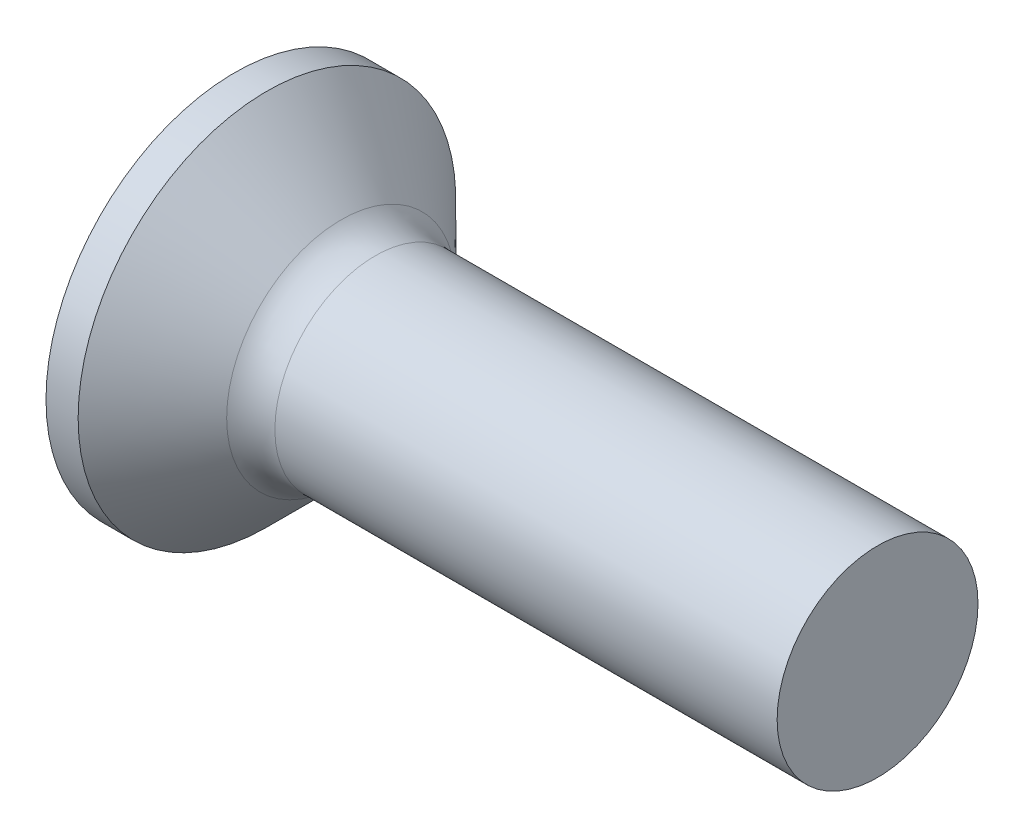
ISO-10303-21;
HEADER;
FILE_DESCRIPTION(('STEP AP214'),'2;1');
FILE_NAME('part.step','',(''),(''),'','','');
FILE_SCHEMA(('AUTOMOTIVE_DESIGN { 1 0 10303 214 1 1 1 1 }'));
ENDSEC;
DATA;
#1=APPLICATION_CONTEXT('core data for automotive mechanical design processes');
#2=APPLICATION_PROTOCOL_DEFINITION('international standard','automotive_design',2000,#1);
#3=PRODUCT_CONTEXT('',#1,'mechanical');
#4=PRODUCT('Part','Part','',(#3));
#5=PRODUCT_RELATED_PRODUCT_CATEGORY('part','',(#4));
#6=PRODUCT_DEFINITION_FORMATION('','',#4);
#7=PRODUCT_DEFINITION_CONTEXT('part definition',#1,'design');
#8=PRODUCT_DEFINITION('design','',#6,#7);
#9=PRODUCT_DEFINITION_SHAPE('','',#8);
#10=(LENGTH_UNIT() NAMED_UNIT(*) SI_UNIT(.MILLI.,.METRE.));
#11=(NAMED_UNIT(*) PLANE_ANGLE_UNIT() SI_UNIT($,.RADIAN.));
#12=(NAMED_UNIT(*) SI_UNIT($,.STERADIAN.) SOLID_ANGLE_UNIT());
#13=UNCERTAINTY_MEASURE_WITH_UNIT(LENGTH_MEASURE(1.E-05),#10,'distance_accuracy_value','');
#14=(GEOMETRIC_REPRESENTATION_CONTEXT(3) GLOBAL_UNCERTAINTY_ASSIGNED_CONTEXT((#13)) GLOBAL_UNIT_ASSIGNED_CONTEXT((#10,
#11,#12)) REPRESENTATION_CONTEXT('',''));
#15=CARTESIAN_POINT('',(0.,0.,0.));
#16=DIRECTION('',(0.,0.,1.));
#17=DIRECTION('',(1.,0.,0.));
#18=AXIS2_PLACEMENT_3D('',#15,#16,#17);
#19=CARTESIAN_POINT('',(1.73,-0.537453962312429,0.37));
#20=DIRECTION('',(0.,0.,-1.));
#21=DIRECTION('',(-1.,0.,0.));
#22=AXIS2_PLACEMENT_3D('',#19,#20,#21);
#23=PLANE('',#22);
#24=DIRECTION('',(0.,-1.,0.));
#25=VECTOR('',#24,1.);
#26=CARTESIAN_POINT('',(0.,1.4,0.37));
#27=LINE('',#26,#25);
#28=CARTESIAN_POINT('',(0.,-0.566915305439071,0.37));
#29=VERTEX_POINT('',#28);
#30=CARTESIAN_POINT('',(0.,-1.4,0.37));
#31=VERTEX_POINT('',#30);
#32=EDGE_CURVE('E460',#29,#31,#27,.T.);
#33=ORIENTED_EDGE('',*,*,#32,.F.);
#34=CARTESIAN_POINT('',(-1.01454775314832,-0.649985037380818,0.37));
#35=CARTESIAN_POINT('',(-0.809029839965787,-0.633442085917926,0.37));
#36=CARTESIAN_POINT('',(-0.603523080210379,-0.616757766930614,0.37));
#37=CARTESIAN_POINT('',(-0.192537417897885,-0.582995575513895,0.37));
#38=CARTESIAN_POINT('',(0.0129414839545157,-0.56591769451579,0.37));
#39=CARTESIAN_POINT('',(0.423856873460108,-0.531258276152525,0.37));
#40=CARTESIAN_POINT('',(0.629293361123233,-0.51367673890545,0.37));
#41=CARTESIAN_POINT('',(1.04010430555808,-0.477832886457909,0.37));
#42=CARTESIAN_POINT('',(1.24547876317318,-0.459570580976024,0.37));
#43=CARTESIAN_POINT('',(1.58556056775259,-0.428522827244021,0.37));
#44=CARTESIAN_POINT('',(1.72029296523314,-0.416012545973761,0.37));
#45=CARTESIAN_POINT('',(1.9897048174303,-0.390443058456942,0.37));
#46=CARTESIAN_POINT('',(2.12438427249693,-0.37738385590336,0.37));
#47=CARTESIAN_POINT('',(2.39367840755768,-0.350538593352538,0.37));
#48=CARTESIAN_POINT('',(2.52829308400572,-0.336752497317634,0.37));
#49=CARTESIAN_POINT('',(2.79740865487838,-0.308085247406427,0.370000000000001));
#50=CARTESIAN_POINT('',(2.93190954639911,-0.293204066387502,0.370000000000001));
#51=CARTESIAN_POINT('',(3.06632904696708,-0.277591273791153,0.370000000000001));
#52=B_SPLINE_CURVE_WITH_KNOTS('',3,(#34,#35,#36,#37,#38,#39,#40,#41,#42,#43,#44,#45,#46,#47,#48,
#49,#50,#51),.UNSPECIFIED.,.F.,.F.,(4,2,2,2,2,2,2,2,4),(0.,0.618548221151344,1.23710992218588,
1.85567147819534,2.47422420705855,2.88015918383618,3.28609143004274,3.69204382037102,
4.09800627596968),.UNSPECIFIED.);
#53=CARTESIAN_POINT('',(1.73,-0.415013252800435,0.370000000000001));
#54=VERTEX_POINT('',#53);
#55=EDGE_CURVE('E216',#29,#54,#52,.T.);
#56=ORIENTED_EDGE('',*,*,#55,.T.);
#57=DIRECTION('',(0.,-1.,0.));
#58=VECTOR('',#57,1.);
#59=CARTESIAN_POINT('',(1.73,0.537453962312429,0.37));
#60=LINE('',#59,#58);
#61=CARTESIAN_POINT('',(1.73,-0.537453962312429,0.37));
#62=VERTEX_POINT('',#61);
#63=EDGE_CURVE('E369',#54,#62,#60,.T.);
#64=ORIENTED_EDGE('',*,*,#63,.T.);
#65=DIRECTION('',(0.894934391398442,0.446197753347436,0.));
#66=VECTOR('',#65,1.);
#67=CARTESIAN_POINT('',(0.,-1.4,0.37));
#68=LINE('',#67,#66);
#69=EDGE_CURVE('E468',#31,#62,#68,.T.);
#70=ORIENTED_EDGE('',*,*,#69,.F.);
#71=EDGE_LOOP('',(#33,#56,#64,#70));
#72=FACE_BOUND('',#71,.T.);
#73=ADVANCED_FACE('F37',(#72),#23,.T.);
#74=CARTESIAN_POINT('',(1.73,0.537453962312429,0.37));
#75=VERTEX_POINT('',#74);
#76=CARTESIAN_POINT('',(1.73,0.415013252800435,0.370000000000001));
#77=VERTEX_POINT('',#76);
#78=EDGE_CURVE('E365',#75,#77,#60,.T.);
#79=ORIENTED_EDGE('',*,*,#78,.T.);
#80=CARTESIAN_POINT('',(-1.01454775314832,0.649985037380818,0.37));
#81=CARTESIAN_POINT('',(-0.809029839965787,0.633442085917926,0.37));
#82=CARTESIAN_POINT('',(-0.603523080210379,0.616757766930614,0.37));
#83=CARTESIAN_POINT('',(-0.192537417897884,0.582995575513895,0.37));
#84=CARTESIAN_POINT('',(0.0129414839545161,0.56591769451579,0.37));
#85=CARTESIAN_POINT('',(0.423856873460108,0.531258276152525,0.37));
#86=CARTESIAN_POINT('',(0.629293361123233,0.513676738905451,0.37));
#87=CARTESIAN_POINT('',(1.04010430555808,0.477832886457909,0.37));
#88=CARTESIAN_POINT('',(1.24547876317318,0.459570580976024,0.37));
#89=CARTESIAN_POINT('',(1.58556056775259,0.42852282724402,0.37));
#90=CARTESIAN_POINT('',(1.72029296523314,0.416012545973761,0.37));
#91=CARTESIAN_POINT('',(1.9897048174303,0.390443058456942,0.37));
#92=CARTESIAN_POINT('',(2.12438427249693,0.37738385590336,0.37));
#93=CARTESIAN_POINT('',(2.39367840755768,0.350538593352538,0.37));
#94=CARTESIAN_POINT('',(2.52829308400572,0.336752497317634,0.37));
#95=CARTESIAN_POINT('',(2.79740865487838,0.308085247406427,0.37));
#96=CARTESIAN_POINT('',(2.93190954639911,0.293204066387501,0.37));
#97=CARTESIAN_POINT('',(3.06632904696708,0.277591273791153,0.37));
#98=B_SPLINE_CURVE_WITH_KNOTS('',3,(#80,#81,#82,#83,#84,#85,#86,#87,#88,#89,#90,#91,#92,#93,#94,
#95,#96,#97),.UNSPECIFIED.,.F.,.F.,(4,2,2,2,2,2,2,2,4),(0.,0.618548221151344,1.23710992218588,
1.85567147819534,2.47422420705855,2.88015918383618,3.28609143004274,3.69204382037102,
4.09800627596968),.UNSPECIFIED.);
#99=CARTESIAN_POINT('',(0.,0.566915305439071,0.37));
#100=VERTEX_POINT('',#99);
#101=EDGE_CURVE('E209',#77,#100,#98,.F.);
#102=ORIENTED_EDGE('',*,*,#101,.T.);
#103=CARTESIAN_POINT('',(0.,1.4,0.37));
#104=VERTEX_POINT('',#103);
#105=EDGE_CURVE('E462',#104,#100,#27,.T.);
#106=ORIENTED_EDGE('',*,*,#105,.F.);
#107=DIRECTION('',(0.894934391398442,-0.446197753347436,0.));
#108=VECTOR('',#107,1.);
#109=CARTESIAN_POINT('',(0.,1.4,0.37));
#110=LINE('',#109,#108);
#111=EDGE_CURVE('E60',#104,#75,#110,.T.);
#112=ORIENTED_EDGE('',*,*,#111,.T.);
#113=EDGE_LOOP('',(#79,#102,#106,#112));
#114=FACE_BOUND('',#113,.T.);
#115=ADVANCED_FACE('F191',(#114),#23,.T.);
#116=CARTESIAN_POINT('',(1.73,0.53745396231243,-0.37));
#117=DIRECTION('',(0.,0.,1.));
#118=DIRECTION('',(1.,0.,0.));
#119=AXIS2_PLACEMENT_3D('',#116,#117,#118);
#120=PLANE('',#119);
#121=DIRECTION('',(0.,1.,0.));
#122=VECTOR('',#121,1.);
#123=CARTESIAN_POINT('',(1.73,-0.537453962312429,-0.37));
#124=LINE('',#123,#122);
#125=CARTESIAN_POINT('',(1.73,-0.537453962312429,-0.37));
#126=VERTEX_POINT('',#125);
#127=CARTESIAN_POINT('',(1.73,-0.415013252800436,-0.37));
#128=VERTEX_POINT('',#127);
#129=EDGE_CURVE('E378',#126,#128,#124,.T.);
#130=ORIENTED_EDGE('',*,*,#129,.T.);
#131=CARTESIAN_POINT('',(-1.01454775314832,-0.649985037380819,-0.369999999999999));
#132=CARTESIAN_POINT('',(-0.809029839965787,-0.633442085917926,-0.369999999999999));
#133=CARTESIAN_POINT('',(-0.603523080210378,-0.616757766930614,-0.369999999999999));
#134=CARTESIAN_POINT('',(-0.192537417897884,-0.582995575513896,-0.369999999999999));
#135=CARTESIAN_POINT('',(0.0129414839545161,-0.565917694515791,-0.369999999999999));
#136=CARTESIAN_POINT('',(0.423856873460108,-0.531258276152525,-0.369999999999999));
#137=CARTESIAN_POINT('',(0.629293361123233,-0.513676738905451,-0.369999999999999));
#138=CARTESIAN_POINT('',(1.04010430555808,-0.477832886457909,-0.37));
#139=CARTESIAN_POINT('',(1.24547876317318,-0.459570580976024,-0.37));
#140=CARTESIAN_POINT('',(1.58556056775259,-0.428522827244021,-0.37));
#141=CARTESIAN_POINT('',(1.72029296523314,-0.416012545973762,-0.37));
#142=CARTESIAN_POINT('',(1.9897048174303,-0.390443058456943,-0.37));
#143=CARTESIAN_POINT('',(2.12438427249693,-0.37738385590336,-0.37));
#144=CARTESIAN_POINT('',(2.39367840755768,-0.350538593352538,-0.37));
#145=CARTESIAN_POINT('',(2.52829308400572,-0.336752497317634,-0.37));
#146=CARTESIAN_POINT('',(2.79740865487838,-0.308085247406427,-0.37));
#147=CARTESIAN_POINT('',(2.93190954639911,-0.293204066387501,-0.37));
#148=CARTESIAN_POINT('',(3.06632904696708,-0.277591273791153,-0.37));
#149=B_SPLINE_CURVE_WITH_KNOTS('',3,(#131,#132,#133,#134,#135,#136,#137,#138,#139,#140,#141,
#142,#143,#144,#145,#146,#147,#148),.UNSPECIFIED.,.F.,.F.,(4,2,2,2,2,2,2,2,4),(0.,
0.618548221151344,1.23710992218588,1.85567147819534,2.47422420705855,2.88015918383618,
3.28609143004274,3.69204382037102,4.09800627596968),.UNSPECIFIED.);
#150=CARTESIAN_POINT('',(0.,-0.566915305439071,-0.369999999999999));
#151=VERTEX_POINT('',#150);
#152=EDGE_CURVE('E272',#128,#151,#149,.F.);
#153=ORIENTED_EDGE('',*,*,#152,.T.);
#154=DIRECTION('',(0.,1.,0.));
#155=VECTOR('',#154,1.);
#156=CARTESIAN_POINT('',(0.,-1.4,-0.369999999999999));
#157=LINE('',#156,#155);
#158=CARTESIAN_POINT('',(0.,-1.4,-0.369999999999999));
#159=VERTEX_POINT('',#158);
#160=EDGE_CURVE('E461',#159,#151,#157,.T.);
#161=ORIENTED_EDGE('',*,*,#160,.F.);
#162=DIRECTION('',(0.894934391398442,0.446197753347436,0.));
#163=VECTOR('',#162,1.);
#164=CARTESIAN_POINT('',(0.,-1.4,-0.369999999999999));
#165=LINE('',#164,#163);
#166=EDGE_CURVE('E471',#159,#126,#165,.T.);
#167=ORIENTED_EDGE('',*,*,#166,.T.);
#168=EDGE_LOOP('',(#130,#153,#161,#167));
#169=FACE_BOUND('',#168,.T.);
#170=ADVANCED_FACE('F197',(#169),#120,.T.);
#171=CARTESIAN_POINT('',(0.,0.566915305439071,-0.369999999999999));
#172=VERTEX_POINT('',#171);
#173=CARTESIAN_POINT('',(0.,1.4,-0.369999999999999));
#174=VERTEX_POINT('',#173);
#175=EDGE_CURVE('E467',#172,#174,#157,.T.);
#176=ORIENTED_EDGE('',*,*,#175,.F.);
#177=CARTESIAN_POINT('',(-1.01454775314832,0.649985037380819,-0.369999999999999));
#178=CARTESIAN_POINT('',(-0.809029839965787,0.633442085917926,-0.369999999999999));
#179=CARTESIAN_POINT('',(-0.603523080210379,0.616757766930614,-0.369999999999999));
#180=CARTESIAN_POINT('',(-0.192537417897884,0.582995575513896,-0.369999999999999));
#181=CARTESIAN_POINT('',(0.0129414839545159,0.565917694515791,-0.369999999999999));
#182=CARTESIAN_POINT('',(0.423856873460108,0.531258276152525,-0.369999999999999));
#183=CARTESIAN_POINT('',(0.629293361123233,0.513676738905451,-0.369999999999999));
#184=CARTESIAN_POINT('',(1.04010430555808,0.477832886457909,-0.37));
#185=CARTESIAN_POINT('',(1.24547876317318,0.459570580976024,-0.37));
#186=CARTESIAN_POINT('',(1.58556056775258,0.428522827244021,-0.37));
#187=CARTESIAN_POINT('',(1.72029296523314,0.416012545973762,-0.37));
#188=CARTESIAN_POINT('',(1.9897048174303,0.390443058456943,-0.37));
#189=CARTESIAN_POINT('',(2.12438427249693,0.37738385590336,-0.37));
#190=CARTESIAN_POINT('',(2.39367840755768,0.350538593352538,-0.37));
#191=CARTESIAN_POINT('',(2.52829308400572,0.336752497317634,-0.37));
#192=CARTESIAN_POINT('',(2.79740865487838,0.308085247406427,-0.37));
#193=CARTESIAN_POINT('',(2.93190954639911,0.293204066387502,-0.37));
#194=CARTESIAN_POINT('',(3.06632904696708,0.277591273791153,-0.370000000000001));
#195=B_SPLINE_CURVE_WITH_KNOTS('',3,(#177,#178,#179,#180,#181,#182,#183,#184,#185,#186,#187,
#188,#189,#190,#191,#192,#193,#194),.UNSPECIFIED.,.F.,.F.,(4,2,2,2,2,2,2,2,4),(0.,
0.618548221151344,1.23710992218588,1.85567147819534,2.47422420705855,2.88015918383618,
3.28609143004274,3.69204382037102,4.09800627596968),.UNSPECIFIED.);
#196=CARTESIAN_POINT('',(1.73,0.415013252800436,-0.37));
#197=VERTEX_POINT('',#196);
#198=EDGE_CURVE('E266',#172,#197,#195,.T.);
#199=ORIENTED_EDGE('',*,*,#198,.T.);
#200=CARTESIAN_POINT('',(1.73,0.53745396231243,-0.37));
#201=VERTEX_POINT('',#200);
#202=EDGE_CURVE('E380',#197,#201,#124,.T.);
#203=ORIENTED_EDGE('',*,*,#202,.T.);
#204=DIRECTION('',(0.894934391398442,-0.446197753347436,0.));
#205=VECTOR('',#204,1.);
#206=CARTESIAN_POINT('',(0.,1.4,-0.369999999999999));
#207=LINE('',#206,#205);
#208=EDGE_CURVE('E377',#174,#201,#207,.T.);
#209=ORIENTED_EDGE('',*,*,#208,.F.);
#210=EDGE_LOOP('',(#176,#199,#203,#209));
#211=FACE_BOUND('',#210,.T.);
#212=ADVANCED_FACE('F478',(#211),#120,.T.);
#213=CARTESIAN_POINT('',(1.73,-0.537453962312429,-0.37));
#214=DIRECTION('',(-1.,0.,0.));
#215=DIRECTION('',(0.,0.,1.));
#216=AXIS2_PLACEMENT_3D('',#213,#214,#215);
#217=PLANE('',#216);
#218=DIRECTION('',(0.,-1.,0.));
#219=VECTOR('',#218,1.);
#220=CARTESIAN_POINT('',(1.73,0.369999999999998,0.537453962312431));
#221=LINE('',#220,#219);
#222=CARTESIAN_POINT('',(1.73,-0.142405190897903,0.537453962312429));
#223=VERTEX_POINT('',#222);
#224=CARTESIAN_POINT('',(1.73,-0.370000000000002,0.537453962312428));
#225=VERTEX_POINT('',#224);
#226=EDGE_CURVE('E450',#223,#225,#221,.T.);
#227=ORIENTED_EDGE('',*,*,#226,.F.);
#228=CARTESIAN_POINT('',(1.73,0.,0.));
#229=DIRECTION('',(-1.,0.,0.));
#230=DIRECTION('',(0.,0.,1.));
#231=AXIS2_PLACEMENT_3D('',#228,#229,#230);
#232=CIRCLE('',#231,0.555999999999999);
#233=CARTESIAN_POINT('',(1.73,-0.370000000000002,0.415013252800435));
#234=VERTEX_POINT('',#233);
#235=EDGE_CURVE('E52',#234,#223,#232,.T.);
#236=ORIENTED_EDGE('',*,*,#235,.F.);
#237=DIRECTION('',(0.,0.,-1.));
#238=VECTOR('',#237,1.);
#239=CARTESIAN_POINT('',(1.73,-0.370000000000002,0.537453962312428));
#240=LINE('',#239,#238);
#241=EDGE_CURVE('E451',#225,#234,#240,.T.);
#242=ORIENTED_EDGE('',*,*,#241,.F.);
#243=EDGE_LOOP('',(#227,#236,#242));
#244=FACE_BOUND('',#243,.T.);
#245=ADVANCED_FACE('F493',(#244),#217,.T.);
#246=ORIENTED_EDGE('',*,*,#63,.F.);
#247=CARTESIAN_POINT('',(1.73,-0.537453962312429,0.142405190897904));
#248=VERTEX_POINT('',#247);
#249=EDGE_CURVE('E334',#248,#54,#232,.T.);
#250=ORIENTED_EDGE('',*,*,#249,.F.);
#251=DIRECTION('',(0.,0.,-1.));
#252=VECTOR('',#251,1.);
#253=CARTESIAN_POINT('',(1.73,-0.537453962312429,0.37));
#254=LINE('',#253,#252);
#255=EDGE_CURVE('E371',#62,#248,#254,.T.);
#256=ORIENTED_EDGE('',*,*,#255,.F.);
#257=EDGE_LOOP('',(#246,#250,#256));
#258=FACE_BOUND('',#257,.T.);
#259=ADVANCED_FACE('F615',(#258),#217,.T.);
#260=CARTESIAN_POINT('',(1.73,-0.537453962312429,-0.142405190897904));
#261=VERTEX_POINT('',#260);
#262=EDGE_CURVE('E368',#261,#126,#254,.T.);
#263=ORIENTED_EDGE('',*,*,#262,.F.);
#264=EDGE_CURVE('E339',#128,#261,#232,.T.);
#265=ORIENTED_EDGE('',*,*,#264,.F.);
#266=ORIENTED_EDGE('',*,*,#129,.F.);
#267=EDGE_LOOP('',(#263,#265,#266));
#268=FACE_BOUND('',#267,.T.);
#269=ADVANCED_FACE('F626',(#268),#217,.T.);
#270=CARTESIAN_POINT('',(1.73,-0.369999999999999,-0.415013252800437));
#271=VERTEX_POINT('',#270);
#272=CARTESIAN_POINT('',(1.73,-0.369999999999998,-0.53745396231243));
#273=VERTEX_POINT('',#272);
#274=EDGE_CURVE('E449',#271,#273,#240,.T.);
#275=ORIENTED_EDGE('',*,*,#274,.F.);
#276=CARTESIAN_POINT('',(1.73,-0.142405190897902,-0.53745396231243));
#277=VERTEX_POINT('',#276);
#278=EDGE_CURVE('E344',#277,#271,#232,.T.);
#279=ORIENTED_EDGE('',*,*,#278,.F.);
#280=DIRECTION('',(0.,1.,0.));
#281=VECTOR('',#280,1.);
#282=CARTESIAN_POINT('',(1.73,-0.369999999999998,-0.53745396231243));
#283=LINE('',#282,#281);
#284=EDGE_CURVE('E445',#273,#277,#283,.T.);
#285=ORIENTED_EDGE('',*,*,#284,.F.);
#286=EDGE_LOOP('',(#275,#279,#285));
#287=FACE_BOUND('',#286,.T.);
#288=ADVANCED_FACE('F488',(#287),#217,.T.);
#289=CARTESIAN_POINT('',(1.73,0.142405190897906,-0.537453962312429));
#290=VERTEX_POINT('',#289);
#291=CARTESIAN_POINT('',(1.73,0.370000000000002,-0.537453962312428));
#292=VERTEX_POINT('',#291);
#293=EDGE_CURVE('E453',#290,#292,#283,.T.);
#294=ORIENTED_EDGE('',*,*,#293,.F.);
#295=CARTESIAN_POINT('',(1.73,0.370000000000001,-0.415013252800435));
#296=VERTEX_POINT('',#295);
#297=EDGE_CURVE('E349',#296,#290,#232,.T.);
#298=ORIENTED_EDGE('',*,*,#297,.F.);
#299=DIRECTION('',(0.,0.,1.));
#300=VECTOR('',#299,1.);
#301=CARTESIAN_POINT('',(1.73,0.370000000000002,-0.537453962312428));
#302=LINE('',#301,#300);
#303=EDGE_CURVE('E455',#292,#296,#302,.T.);
#304=ORIENTED_EDGE('',*,*,#303,.F.);
#305=EDGE_LOOP('',(#294,#298,#304));
#306=FACE_BOUND('',#305,.T.);
#307=ADVANCED_FACE('F482',(#306),#217,.T.);
#308=ORIENTED_EDGE('',*,*,#202,.F.);
#309=CARTESIAN_POINT('',(1.73,0.537453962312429,-0.142405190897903));
#310=VERTEX_POINT('',#309);
#311=EDGE_CURVE('E354',#310,#197,#232,.T.);
#312=ORIENTED_EDGE('',*,*,#311,.F.);
#313=DIRECTION('',(0.,0.,1.));
#314=VECTOR('',#313,1.);
#315=CARTESIAN_POINT('',(1.73,0.53745396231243,-0.37));
#316=LINE('',#315,#314);
#317=EDGE_CURVE('E373',#201,#310,#316,.T.);
#318=ORIENTED_EDGE('',*,*,#317,.F.);
#319=EDGE_LOOP('',(#308,#312,#318));
#320=FACE_BOUND('',#319,.T.);
#321=ADVANCED_FACE('F480',(#320),#217,.T.);
#322=CARTESIAN_POINT('',(1.73,0.537453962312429,0.142405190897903));
#323=VERTEX_POINT('',#322);
#324=EDGE_CURVE('E366',#323,#75,#316,.T.);
#325=ORIENTED_EDGE('',*,*,#324,.F.);
#326=EDGE_CURVE('E332',#77,#323,#232,.T.);
#327=ORIENTED_EDGE('',*,*,#326,.F.);
#328=ORIENTED_EDGE('',*,*,#78,.F.);
#329=EDGE_LOOP('',(#325,#327,#328));
#330=FACE_BOUND('',#329,.T.);
#331=ADVANCED_FACE('F364',(#330),#217,.T.);
#332=CARTESIAN_POINT('',(1.73,-0.537453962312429,-0.37));
#333=DIRECTION('',(-0.446197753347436,0.894934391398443,0.));
#334=DIRECTION('',(-0.894934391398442,-0.446197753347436,0.));
#335=AXIS2_PLACEMENT_3D('',#332,#333,#334);
#336=PLANE('',#335);
#337=ORIENTED_EDGE('',*,*,#255,.T.);
#338=CARTESIAN_POINT('',(2.6700539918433,-0.0687604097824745,0.));
#339=DIRECTION('',(-0.446197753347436,0.894934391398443,0.));
#340=DIRECTION('',(-0.894934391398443,-0.446197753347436,0.));
#341=AXIS2_PLACEMENT_3D('',#338,#339,#340);
#342=ELLIPSE('',#341,1.09876174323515,0.485419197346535);
#343=EDGE_CURVE('E284',#248,#261,#342,.F.);
#344=ORIENTED_EDGE('',*,*,#343,.T.);
#345=ORIENTED_EDGE('',*,*,#262,.T.);
#346=ORIENTED_EDGE('',*,*,#166,.F.);
#347=DIRECTION('',(0.,0.,-1.));
#348=VECTOR('',#347,1.);
#349=CARTESIAN_POINT('',(0.,-1.4,0.37));
#350=LINE('',#349,#348);
#351=EDGE_CURVE('E385',#31,#159,#350,.T.);
#352=ORIENTED_EDGE('',*,*,#351,.F.);
#353=ORIENTED_EDGE('',*,*,#69,.T.);
#354=EDGE_LOOP('',(#337,#344,#345,#346,#352,#353));
#355=FACE_BOUND('',#354,.T.);
#356=ADVANCED_FACE('F203',(#355),#336,.T.);
#357=CARTESIAN_POINT('',(0.,1.4,0.37));
#358=DIRECTION('',(-0.446197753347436,-0.894934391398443,0.));
#359=DIRECTION('',(0.894934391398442,-0.446197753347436,0.));
#360=AXIS2_PLACEMENT_3D('',#357,#358,#359);
#361=PLANE('',#360);
#362=ORIENTED_EDGE('',*,*,#317,.T.);
#363=CARTESIAN_POINT('',(2.6700539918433,0.0687604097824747,0.));
#364=DIRECTION('',(-0.446197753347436,-0.894934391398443,0.));
#365=DIRECTION('',(-0.894934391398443,0.446197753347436,0.));
#366=AXIS2_PLACEMENT_3D('',#363,#364,#365);
#367=ELLIPSE('',#366,1.09876174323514,0.485419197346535);
#368=EDGE_CURVE('E289',#310,#323,#367,.F.);
#369=ORIENTED_EDGE('',*,*,#368,.T.);
#370=ORIENTED_EDGE('',*,*,#324,.T.);
#371=ORIENTED_EDGE('',*,*,#111,.F.);
#372=DIRECTION('',(0.,0.,1.));
#373=VECTOR('',#372,1.);
#374=CARTESIAN_POINT('',(0.,1.4,-0.369999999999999));
#375=LINE('',#374,#373);
#376=EDGE_CURVE('E457',#174,#104,#375,.T.);
#377=ORIENTED_EDGE('',*,*,#376,.F.);
#378=ORIENTED_EDGE('',*,*,#208,.T.);
#379=EDGE_LOOP('',(#362,#369,#370,#371,#377,#378));
#380=FACE_BOUND('',#379,.T.);
#381=ADVANCED_FACE('F476',(#380),#361,.T.);
#382=CARTESIAN_POINT('',(1.73,-0.369999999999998,-0.53745396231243));
#383=DIRECTION('',(0.,1.,0.));
#384=DIRECTION('',(-1.,0.,0.));
#385=AXIS2_PLACEMENT_3D('',#382,#383,#384);
#386=PLANE('',#385);
#387=DIRECTION('',(0.,0.,-1.));
#388=VECTOR('',#387,1.);
#389=CARTESIAN_POINT('',(0.,-0.370000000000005,1.4));
#390=LINE('',#389,#388);
#391=CARTESIAN_POINT('',(0.,-0.369999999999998,-0.566915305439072));
#392=VERTEX_POINT('',#391);
#393=CARTESIAN_POINT('',(0.,-0.369999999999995,-1.4));
#394=VERTEX_POINT('',#393);
#395=EDGE_CURVE('E427',#392,#394,#390,.T.);
#396=ORIENTED_EDGE('',*,*,#395,.F.);
#397=CARTESIAN_POINT('',(-1.01454775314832,-0.369999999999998,-0.649985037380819));
#398=CARTESIAN_POINT('',(-0.809029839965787,-0.369999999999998,-0.633442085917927));
#399=CARTESIAN_POINT('',(-0.603523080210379,-0.369999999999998,-0.616757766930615));
#400=CARTESIAN_POINT('',(-0.192537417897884,-0.369999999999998,-0.582995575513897));
#401=CARTESIAN_POINT('',(0.0129414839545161,-0.369999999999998,-0.565917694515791));
#402=CARTESIAN_POINT('',(0.423856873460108,-0.369999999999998,-0.531258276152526));
#403=CARTESIAN_POINT('',(0.629293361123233,-0.369999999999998,-0.513676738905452));
#404=CARTESIAN_POINT('',(1.04010430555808,-0.369999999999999,-0.47783288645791));
#405=CARTESIAN_POINT('',(1.24547876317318,-0.369999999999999,-0.459570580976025));
#406=CARTESIAN_POINT('',(1.58556056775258,-0.369999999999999,-0.428522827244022));
#407=CARTESIAN_POINT('',(1.72029296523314,-0.369999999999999,-0.416012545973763));
#408=CARTESIAN_POINT('',(1.9897048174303,-0.369999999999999,-0.390443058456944));
#409=CARTESIAN_POINT('',(2.12438427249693,-0.369999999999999,-0.377383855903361));
#410=CARTESIAN_POINT('',(2.39367840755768,-0.369999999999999,-0.350538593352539));
#411=CARTESIAN_POINT('',(2.52829308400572,-0.369999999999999,-0.336752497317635));
#412=CARTESIAN_POINT('',(2.79740865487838,-0.369999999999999,-0.308085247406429));
#413=CARTESIAN_POINT('',(2.93190954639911,-0.369999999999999,-0.293204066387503));
#414=CARTESIAN_POINT('',(3.06632904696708,-0.37,-0.277591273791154));
#415=B_SPLINE_CURVE_WITH_KNOTS('',3,(#397,#398,#399,#400,#401,#402,#403,#404,#405,#406,#407,
#408,#409,#410,#411,#412,#413,#414),.UNSPECIFIED.,.F.,.F.,(4,2,2,2,2,2,2,2,4),(0.,
0.618548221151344,1.23710992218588,1.85567147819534,2.47422420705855,2.88015918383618,
3.28609143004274,3.69204382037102,4.09800627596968),.UNSPECIFIED.);
#416=EDGE_CURVE('E258',#392,#271,#415,.T.);
#417=ORIENTED_EDGE('',*,*,#416,.T.);
#418=ORIENTED_EDGE('',*,*,#274,.T.);
#419=DIRECTION('',(0.894934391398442,0.,0.446197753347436));
#420=VECTOR('',#419,1.);
#421=CARTESIAN_POINT('',(0.,-0.369999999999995,-1.4));
#422=LINE('',#421,#420);
#423=EDGE_CURVE('E434',#394,#273,#422,.T.);
#424=ORIENTED_EDGE('',*,*,#423,.F.);
#425=EDGE_LOOP('',(#396,#417,#418,#424));
#426=FACE_BOUND('',#425,.T.);
#427=ADVANCED_FACE('F680',(#426),#386,.T.);
#428=CARTESIAN_POINT('',(1.73,0.369999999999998,0.537453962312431));
#429=DIRECTION('',(0.,-1.,0.));
#430=DIRECTION('',(1.,0.,0.));
#431=AXIS2_PLACEMENT_3D('',#428,#429,#430);
#432=PLANE('',#431);
#433=ORIENTED_EDGE('',*,*,#303,.T.);
#434=CARTESIAN_POINT('',(-1.01454775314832,0.370000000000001,-0.649985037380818));
#435=CARTESIAN_POINT('',(-0.809029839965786,0.370000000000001,-0.633442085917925));
#436=CARTESIAN_POINT('',(-0.603523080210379,0.370000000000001,-0.616757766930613));
#437=CARTESIAN_POINT('',(-0.192537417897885,0.370000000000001,-0.582995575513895));
#438=CARTESIAN_POINT('',(0.0129414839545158,0.370000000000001,-0.565917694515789));
#439=CARTESIAN_POINT('',(0.423856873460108,0.370000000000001,-0.531258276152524));
#440=CARTESIAN_POINT('',(0.629293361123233,0.370000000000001,-0.51367673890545));
#441=CARTESIAN_POINT('',(1.04010430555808,0.370000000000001,-0.477832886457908));
#442=CARTESIAN_POINT('',(1.24547876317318,0.370000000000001,-0.459570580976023));
#443=CARTESIAN_POINT('',(1.58556056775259,0.370000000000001,-0.42852282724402));
#444=CARTESIAN_POINT('',(1.72029296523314,0.370000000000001,-0.41601254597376));
#445=CARTESIAN_POINT('',(1.9897048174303,0.370000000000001,-0.390443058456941));
#446=CARTESIAN_POINT('',(2.12438427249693,0.370000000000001,-0.377383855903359));
#447=CARTESIAN_POINT('',(2.39367840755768,0.370000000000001,-0.350538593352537));
#448=CARTESIAN_POINT('',(2.52829308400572,0.370000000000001,-0.336752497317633));
#449=CARTESIAN_POINT('',(2.79740865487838,0.370000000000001,-0.308085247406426));
#450=CARTESIAN_POINT('',(2.93190954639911,0.370000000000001,-0.2932040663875));
#451=CARTESIAN_POINT('',(3.06632904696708,0.370000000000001,-0.277591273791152));
#452=B_SPLINE_CURVE_WITH_KNOTS('',3,(#434,#435,#436,#437,#438,#439,#440,#441,#442,#443,#444,
#445,#446,#447,#448,#449,#450,#451),.UNSPECIFIED.,.F.,.F.,(4,2,2,2,2,2,2,2,4),(0.,
0.618548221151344,1.23710992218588,1.85567147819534,2.47422420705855,2.88015918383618,
3.28609143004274,3.69204382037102,4.09800627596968),.UNSPECIFIED.);
#453=CARTESIAN_POINT('',(0.,0.370000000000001,-0.56691530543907));
#454=VERTEX_POINT('',#453);
#455=EDGE_CURVE('E251',#296,#454,#452,.F.);
#456=ORIENTED_EDGE('',*,*,#455,.T.);
#457=DIRECTION('',(0.,0.,1.));
#458=VECTOR('',#457,1.);
#459=CARTESIAN_POINT('',(0.,0.370000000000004,-1.4));
#460=LINE('',#459,#458);
#461=CARTESIAN_POINT('',(0.,0.370000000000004,-1.4));
#462=VERTEX_POINT('',#461);
#463=EDGE_CURVE('E431',#462,#454,#460,.T.);
#464=ORIENTED_EDGE('',*,*,#463,.F.);
#465=DIRECTION('',(0.894934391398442,0.,0.446197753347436));
#466=VECTOR('',#465,1.);
#467=CARTESIAN_POINT('',(0.,0.370000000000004,-1.4));
#468=LINE('',#467,#466);
#469=EDGE_CURVE('E437',#462,#292,#468,.T.);
#470=ORIENTED_EDGE('',*,*,#469,.T.);
#471=EDGE_LOOP('',(#433,#456,#464,#470));
#472=FACE_BOUND('',#471,.T.);
#473=ADVANCED_FACE('F688',(#472),#432,.T.);
#474=CARTESIAN_POINT('',(1.73,0.370000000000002,-0.537453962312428));
#475=DIRECTION('',(-0.446197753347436,0.,0.894934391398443));
#476=DIRECTION('',(-0.894934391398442,0.,-0.446197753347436));
#477=AXIS2_PLACEMENT_3D('',#474,#475,#476);
#478=PLANE('',#477);
#479=ORIENTED_EDGE('',*,*,#284,.T.);
#480=CARTESIAN_POINT('',(2.6700539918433,0.,-0.0687604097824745));
#481=DIRECTION('',(-0.446197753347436,0.,0.894934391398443));
#482=DIRECTION('',(-0.894934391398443,0.,-0.446197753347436));
#483=AXIS2_PLACEMENT_3D('',#480,#481,#482);
#484=ELLIPSE('',#483,1.09876174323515,0.485419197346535);
#485=EDGE_CURVE('E301',#277,#290,#484,.F.);
#486=ORIENTED_EDGE('',*,*,#485,.T.);
#487=ORIENTED_EDGE('',*,*,#293,.T.);
#488=ORIENTED_EDGE('',*,*,#469,.F.);
#489=DIRECTION('',(0.,1.,0.));
#490=VECTOR('',#489,1.);
#491=CARTESIAN_POINT('',(0.,-0.369999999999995,-1.4));
#492=LINE('',#491,#490);
#493=EDGE_CURVE('E426',#394,#462,#492,.T.);
#494=ORIENTED_EDGE('',*,*,#493,.F.);
#495=ORIENTED_EDGE('',*,*,#423,.T.);
#496=EDGE_LOOP('',(#479,#486,#487,#488,#494,#495));
#497=FACE_BOUND('',#496,.T.);
#498=ADVANCED_FACE('F228',(#497),#478,.T.);
#499=ORIENTED_EDGE('',*,*,#241,.T.);
#500=CARTESIAN_POINT('',(-1.01454775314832,-0.370000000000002,0.649985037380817));
#501=CARTESIAN_POINT('',(-0.809029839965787,-0.370000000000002,0.633442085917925));
#502=CARTESIAN_POINT('',(-0.603523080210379,-0.370000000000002,0.616757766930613));
#503=CARTESIAN_POINT('',(-0.192537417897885,-0.370000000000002,0.582995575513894));
#504=CARTESIAN_POINT('',(0.0129414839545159,-0.370000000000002,0.565917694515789));
#505=CARTESIAN_POINT('',(0.423856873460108,-0.370000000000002,0.531258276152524));
#506=CARTESIAN_POINT('',(0.629293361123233,-0.370000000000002,0.513676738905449));
#507=CARTESIAN_POINT('',(1.04010430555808,-0.370000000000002,0.477832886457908));
#508=CARTESIAN_POINT('',(1.24547876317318,-0.370000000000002,0.459570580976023));
#509=CARTESIAN_POINT('',(1.58556056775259,-0.370000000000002,0.428522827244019));
#510=CARTESIAN_POINT('',(1.72029296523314,-0.370000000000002,0.41601254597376));
#511=CARTESIAN_POINT('',(1.9897048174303,-0.370000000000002,0.390443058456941));
#512=CARTESIAN_POINT('',(2.12438427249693,-0.370000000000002,0.377383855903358));
#513=CARTESIAN_POINT('',(2.39367840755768,-0.370000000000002,0.350538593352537));
#514=CARTESIAN_POINT('',(2.52829308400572,-0.370000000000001,0.336752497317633));
#515=CARTESIAN_POINT('',(2.79740865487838,-0.370000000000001,0.308085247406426));
#516=CARTESIAN_POINT('',(2.93190954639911,-0.370000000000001,0.2932040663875));
#517=CARTESIAN_POINT('',(3.06632904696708,-0.370000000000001,0.277591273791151));
#518=B_SPLINE_CURVE_WITH_KNOTS('',3,(#500,#501,#502,#503,#504,#505,#506,#507,#508,#509,#510,
#511,#512,#513,#514,#515,#516,#517),.UNSPECIFIED.,.F.,.F.,(4,2,2,2,2,2,2,2,4),(0.,
0.618548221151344,1.23710992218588,1.85567147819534,2.47422420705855,2.88015918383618,
3.28609143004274,3.69204382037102,4.09800627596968),.UNSPECIFIED.);
#519=CARTESIAN_POINT('',(0.,-0.370000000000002,0.56691530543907));
#520=VERTEX_POINT('',#519);
#521=EDGE_CURVE('E243',#234,#520,#518,.F.);
#522=ORIENTED_EDGE('',*,*,#521,.T.);
#523=CARTESIAN_POINT('',(0.,-0.370000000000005,1.4));
#524=VERTEX_POINT('',#523);
#525=EDGE_CURVE('E422',#524,#520,#390,.T.);
#526=ORIENTED_EDGE('',*,*,#525,.F.);
#527=DIRECTION('',(0.894934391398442,0.,-0.446197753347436));
#528=VECTOR('',#527,1.);
#529=CARTESIAN_POINT('',(0.,-0.370000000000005,1.4));
#530=LINE('',#529,#528);
#531=EDGE_CURVE('E440',#524,#225,#530,.T.);
#532=ORIENTED_EDGE('',*,*,#531,.T.);
#533=EDGE_LOOP('',(#499,#522,#526,#532));
#534=FACE_BOUND('',#533,.T.);
#535=ADVANCED_FACE('F689',(#534),#386,.T.);
#536=CARTESIAN_POINT('',(0.,0.369999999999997,0.566915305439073));
#537=VERTEX_POINT('',#536);
#538=CARTESIAN_POINT('',(0.,0.369999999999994,1.4));
#539=VERTEX_POINT('',#538);
#540=EDGE_CURVE('E433',#537,#539,#460,.T.);
#541=ORIENTED_EDGE('',*,*,#540,.F.);
#542=CARTESIAN_POINT('',(-1.01454775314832,0.369999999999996,0.64998503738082));
#543=CARTESIAN_POINT('',(-0.809029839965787,0.369999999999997,0.633442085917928));
#544=CARTESIAN_POINT('',(-0.603523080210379,0.369999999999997,0.616757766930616));
#545=CARTESIAN_POINT('',(-0.192537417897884,0.369999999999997,0.582995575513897));
#546=CARTESIAN_POINT('',(0.0129414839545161,0.369999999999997,0.565917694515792));
#547=CARTESIAN_POINT('',(0.423856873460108,0.369999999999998,0.531258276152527));
#548=CARTESIAN_POINT('',(0.629293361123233,0.369999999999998,0.513676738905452));
#549=CARTESIAN_POINT('',(1.04010430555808,0.369999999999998,0.477832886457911));
#550=CARTESIAN_POINT('',(1.24547876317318,0.369999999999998,0.459570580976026));
#551=CARTESIAN_POINT('',(1.58556056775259,0.369999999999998,0.428522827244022));
#552=CARTESIAN_POINT('',(1.72029296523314,0.369999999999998,0.416012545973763));
#553=CARTESIAN_POINT('',(1.9897048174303,0.369999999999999,0.390443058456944));
#554=CARTESIAN_POINT('',(2.12438427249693,0.369999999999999,0.377383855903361));
#555=CARTESIAN_POINT('',(2.39367840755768,0.369999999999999,0.350538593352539));
#556=CARTESIAN_POINT('',(2.52829308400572,0.369999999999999,0.336752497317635));
#557=CARTESIAN_POINT('',(2.79740865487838,0.369999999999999,0.308085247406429));
#558=CARTESIAN_POINT('',(2.93190954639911,0.369999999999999,0.293204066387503));
#559=CARTESIAN_POINT('',(3.06632904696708,0.37,0.277591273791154));
#560=B_SPLINE_CURVE_WITH_KNOTS('',3,(#542,#543,#544,#545,#546,#547,#548,#549,#550,#551,#552,
#553,#554,#555,#556,#557,#558,#559),.UNSPECIFIED.,.F.,.F.,(4,2,2,2,2,2,2,2,4),(0.,
0.618548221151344,1.23710992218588,1.85567147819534,2.47422420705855,2.88015918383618,
3.28609143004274,3.69204382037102,4.09800627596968),.UNSPECIFIED.);
#561=CARTESIAN_POINT('',(1.73,0.369999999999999,0.415013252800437));
#562=VERTEX_POINT('',#561);
#563=EDGE_CURVE('E233',#537,#562,#560,.T.);
#564=ORIENTED_EDGE('',*,*,#563,.T.);
#565=CARTESIAN_POINT('',(1.73,0.369999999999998,0.537453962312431));
#566=VERTEX_POINT('',#565);
#567=EDGE_CURVE('E223',#562,#566,#302,.T.);
#568=ORIENTED_EDGE('',*,*,#567,.T.);
#569=DIRECTION('',(0.894934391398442,0.,-0.446197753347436));
#570=VECTOR('',#569,1.);
#571=CARTESIAN_POINT('',(0.,0.369999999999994,1.4));
#572=LINE('',#571,#570);
#573=EDGE_CURVE('E442',#539,#566,#572,.T.);
#574=ORIENTED_EDGE('',*,*,#573,.F.);
#575=EDGE_LOOP('',(#541,#564,#568,#574));
#576=FACE_BOUND('',#575,.T.);
#577=ADVANCED_FACE('F697',(#576),#432,.T.);
#578=CARTESIAN_POINT('',(0.,-0.370000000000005,1.4));
#579=DIRECTION('',(-0.446197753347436,0.,-0.894934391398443));
#580=DIRECTION('',(0.894934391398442,0.,-0.446197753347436));
#581=AXIS2_PLACEMENT_3D('',#578,#579,#580);
#582=PLANE('',#581);
#583=CARTESIAN_POINT('',(1.73,0.142405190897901,0.53745396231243));
#584=VERTEX_POINT('',#583);
#585=EDGE_CURVE('E446',#566,#584,#221,.T.);
#586=ORIENTED_EDGE('',*,*,#585,.T.);
#587=CARTESIAN_POINT('',(2.6700539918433,0.,0.0687604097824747));
#588=DIRECTION('',(-0.446197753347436,0.,-0.894934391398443));
#589=DIRECTION('',(-0.894934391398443,0.,0.446197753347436));
#590=AXIS2_PLACEMENT_3D('',#587,#588,#589);
#591=ELLIPSE('',#590,1.09876174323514,0.485419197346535);
#592=EDGE_CURVE('E11',#584,#223,#591,.F.);
#593=ORIENTED_EDGE('',*,*,#592,.T.);
#594=ORIENTED_EDGE('',*,*,#226,.T.);
#595=ORIENTED_EDGE('',*,*,#531,.F.);
#596=DIRECTION('',(0.,-1.,0.));
#597=VECTOR('',#596,1.);
#598=CARTESIAN_POINT('',(0.,0.369999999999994,1.4));
#599=LINE('',#598,#597);
#600=EDGE_CURVE('E224',#539,#524,#599,.T.);
#601=ORIENTED_EDGE('',*,*,#600,.F.);
#602=ORIENTED_EDGE('',*,*,#573,.T.);
#603=EDGE_LOOP('',(#586,#593,#594,#595,#601,#602));
#604=FACE_BOUND('',#603,.T.);
#605=ADVANCED_FACE('F420',(#604),#582,.T.);
#606=CARTESIAN_POINT('',(0.,0.,0.));
#607=DIRECTION('',(-1.,0.,0.));
#608=DIRECTION('',(0.,0.,1.));
#609=AXIS2_PLACEMENT_3D('',#606,#607,#608);
#610=PLANE('',#609);
#611=CARTESIAN_POINT('',(0.,0.,0.));
#612=DIRECTION('',(-1.,0.,0.));
#613=DIRECTION('',(0.,0.,1.));
#614=AXIS2_PLACEMENT_3D('',#611,#612,#613);
#615=CIRCLE('',#614,2.35);
#616=CARTESIAN_POINT('',(0.,0.,2.35));
#617=VERTEX_POINT('',#616);
#618=EDGE_CURVE('E388',#617,#617,#615,.T.);
#619=ORIENTED_EDGE('',*,*,#618,.T.);
#620=EDGE_LOOP('',(#619));
#621=FACE_BOUND('',#620,.T.);
#622=ORIENTED_EDGE('',*,*,#525,.T.);
#623=CARTESIAN_POINT('',(0.,0.,0.));
#624=DIRECTION('',(-1.,0.,0.));
#625=DIRECTION('',(0.,0.,1.));
#626=AXIS2_PLACEMENT_3D('',#623,#624,#625);
#627=CIRCLE('',#626,0.676973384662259);
#628=EDGE_CURVE('E320',#29,#520,#627,.T.);
#629=ORIENTED_EDGE('',*,*,#628,.F.);
#630=ORIENTED_EDGE('',*,*,#32,.T.);
#631=ORIENTED_EDGE('',*,*,#351,.T.);
#632=ORIENTED_EDGE('',*,*,#160,.T.);
#633=EDGE_CURVE('E323',#392,#151,#627,.T.);
#634=ORIENTED_EDGE('',*,*,#633,.F.);
#635=ORIENTED_EDGE('',*,*,#395,.T.);
#636=ORIENTED_EDGE('',*,*,#493,.T.);
#637=ORIENTED_EDGE('',*,*,#463,.T.);
#638=EDGE_CURVE('E319',#172,#454,#627,.T.);
#639=ORIENTED_EDGE('',*,*,#638,.F.);
#640=ORIENTED_EDGE('',*,*,#175,.T.);
#641=ORIENTED_EDGE('',*,*,#376,.T.);
#642=ORIENTED_EDGE('',*,*,#105,.T.);
#643=EDGE_CURVE('E315',#537,#100,#627,.T.);
#644=ORIENTED_EDGE('',*,*,#643,.F.);
#645=ORIENTED_EDGE('',*,*,#540,.T.);
#646=ORIENTED_EDGE('',*,*,#600,.T.);
#647=EDGE_LOOP('',(#622,#629,#630,#631,#632,#634,#635,#636,#637,#639,#640,#641,#642,#644,#645,#646));
#648=FACE_BOUND('',#647,.T.);
#649=ADVANCED_FACE('F414',(#621,#648),#610,.T.);
#650=CARTESIAN_POINT('',(-6.34999999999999,0.,0.));
#651=DIRECTION('',(-1.,0.,0.));
#652=DIRECTION('',(0.,0.,1.));
#653=AXIS2_PLACEMENT_3D('',#650,#651,#652);
#654=CYLINDRICAL_SURFACE('',#653,2.35);
#655=CARTESIAN_POINT('',(0.400000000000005,0.,0.));
#656=DIRECTION('',(-1.,0.,0.));
#657=DIRECTION('',(0.,0.,1.));
#658=AXIS2_PLACEMENT_3D('',#655,#656,#657);
#659=CIRCLE('',#658,2.35);
#660=CARTESIAN_POINT('',(0.400000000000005,0.,2.35));
#661=VERTEX_POINT('',#660);
#662=EDGE_CURVE('E384',#661,#661,#659,.T.);
#663=ORIENTED_EDGE('',*,*,#662,.T.);
#664=EDGE_LOOP('',(#663));
#665=FACE_BOUND('',#664,.T.);
#666=ORIENTED_EDGE('',*,*,#618,.F.);
#667=EDGE_LOOP('',(#666));
#668=FACE_BOUND('',#667,.T.);
#669=ADVANCED_FACE('F408',(#665,#668),#654,.T.);
#670=CARTESIAN_POINT('',(0.400000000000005,0.,0.));
#671=DIRECTION('',(-1.,0.,0.));
#672=DIRECTION('',(0.,0.,1.));
#673=AXIS2_PLACEMENT_3D('',#670,#671,#672);
#674=CONICAL_SURFACE('',#673,2.35,0.78539816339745);
#675=CARTESIAN_POINT('',(1.32426406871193,0.,0.));
#676=DIRECTION('',(-1.,0.,0.));
#677=DIRECTION('',(0.,0.,1.));
#678=AXIS2_PLACEMENT_3D('',#675,#676,#677);
#679=CIRCLE('',#678,1.42573593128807);
#680=CARTESIAN_POINT('',(1.32426406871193,0.,1.42573593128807));
#681=VERTEX_POINT('',#680);
#682=EDGE_CURVE('E391',#681,#681,#679,.T.);
#683=ORIENTED_EDGE('',*,*,#682,.T.);
#684=EDGE_LOOP('',(#683));
#685=FACE_BOUND('',#684,.T.);
#686=ORIENTED_EDGE('',*,*,#662,.F.);
#687=EDGE_LOOP('',(#686));
#688=FACE_BOUND('',#687,.T.);
#689=ADVANCED_FACE('F405',(#685,#688),#674,.T.);
#690=CARTESIAN_POINT('',(-6.34999999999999,0.,0.));
#691=DIRECTION('',(-1.,0.,0.));
#692=DIRECTION('',(0.,0.,1.));
#693=AXIS2_PLACEMENT_3D('',#690,#691,#692);
#694=CYLINDRICAL_SURFACE('',#693,1.25);
#695=CARTESIAN_POINT('',(1.74852813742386,0.,0.));
#696=DIRECTION('',(-1.,0.,0.));
#697=DIRECTION('',(0.,0.,1.));
#698=AXIS2_PLACEMENT_3D('',#695,#696,#697);
#699=CIRCLE('',#698,1.25);
#700=CARTESIAN_POINT('',(1.74852813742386,0.,1.25));
#701=VERTEX_POINT('',#700);
#702=EDGE_CURVE('E45',#701,#701,#699,.F.);
#703=ORIENTED_EDGE('',*,*,#702,.T.);
#704=EDGE_LOOP('',(#703));
#705=FACE_BOUND('',#704,.T.);
#706=CARTESIAN_POINT('',(8.,0.,0.));
#707=DIRECTION('',(-1.,0.,0.));
#708=DIRECTION('',(0.,0.,1.));
#709=AXIS2_PLACEMENT_3D('',#706,#707,#708);
#710=CIRCLE('',#709,1.25);
#711=CARTESIAN_POINT('',(8.,0.,1.25));
#712=VERTEX_POINT('',#711);
#713=EDGE_CURVE('E381',#712,#712,#710,.T.);
#714=ORIENTED_EDGE('',*,*,#713,.T.);
#715=EDGE_LOOP('',(#714));
#716=FACE_BOUND('',#715,.T.);
#717=ADVANCED_FACE('F396',(#705,#716),#694,.T.);
#718=CARTESIAN_POINT('',(8.,1.25,0.));
#719=DIRECTION('',(1.,0.,0.));
#720=DIRECTION('',(0.,0.,-1.));
#721=AXIS2_PLACEMENT_3D('',#718,#719,#720);
#722=PLANE('',#721);
#723=ORIENTED_EDGE('',*,*,#713,.F.);
#724=EDGE_LOOP('',(#723));
#725=FACE_BOUND('',#724,.T.);
#726=ADVANCED_FACE('F402',(#725),#722,.T.);
#727=CARTESIAN_POINT('',(1.74852813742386,0.,0.));
#728=DIRECTION('',(-1.,0.,0.));
#729=DIRECTION('',(0.,0.,1.));
#730=AXIS2_PLACEMENT_3D('',#727,#728,#729);
#731=TOROIDAL_SURFACE('',#730,1.85,0.6);
#732=ORIENTED_EDGE('',*,*,#702,.F.);
#733=EDGE_LOOP('',(#732));
#734=FACE_BOUND('',#733,.T.);
#735=ORIENTED_EDGE('',*,*,#682,.F.);
#736=EDGE_LOOP('',(#735));
#737=FACE_BOUND('',#736,.T.);
#738=ADVANCED_FACE('F39',(#734,#737),#731,.F.);
#739=ORIENTED_EDGE('',*,*,#567,.F.);
#740=EDGE_CURVE('E325',#584,#562,#232,.T.);
#741=ORIENTED_EDGE('',*,*,#740,.F.);
#742=ORIENTED_EDGE('',*,*,#585,.F.);
#743=EDGE_LOOP('',(#739,#741,#742));
#744=FACE_BOUND('',#743,.T.);
#745=ADVANCED_FACE('F401',(#744),#217,.T.);
#746=CARTESIAN_POINT('',(1.73,0.,0.));
#747=DIRECTION('',(-1.,0.,0.));
#748=DIRECTION('',(0.,0.,1.));
#749=AXIS2_PLACEMENT_3D('',#746,#747,#748);
#750=CONICAL_SURFACE('',#749,0.555999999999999,0.0698131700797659);
#751=ORIENTED_EDGE('',*,*,#628,.T.);
#752=ORIENTED_EDGE('',*,*,#521,.F.);
#753=EDGE_CURVE('E333',#54,#234,#232,.T.);
#754=ORIENTED_EDGE('',*,*,#753,.F.);
#755=ORIENTED_EDGE('',*,*,#55,.F.);
#756=EDGE_LOOP('',(#751,#752,#754,#755));
#757=FACE_BOUND('',#756,.T.);
#758=ADVANCED_FACE('F188',(#757),#750,.F.);
#759=EDGE_CURVE('E328',#562,#77,#232,.T.);
#760=ORIENTED_EDGE('',*,*,#759,.F.);
#761=ORIENTED_EDGE('',*,*,#563,.F.);
#762=ORIENTED_EDGE('',*,*,#643,.T.);
#763=ORIENTED_EDGE('',*,*,#101,.F.);
#764=EDGE_LOOP('',(#760,#761,#762,#763));
#765=FACE_BOUND('',#764,.T.);
#766=ADVANCED_FACE('F523',(#765),#750,.F.);
#767=EDGE_CURVE('E341',#271,#128,#232,.T.);
#768=ORIENTED_EDGE('',*,*,#767,.F.);
#769=ORIENTED_EDGE('',*,*,#416,.F.);
#770=ORIENTED_EDGE('',*,*,#633,.T.);
#771=ORIENTED_EDGE('',*,*,#152,.F.);
#772=EDGE_LOOP('',(#768,#769,#770,#771));
#773=FACE_BOUND('',#772,.T.);
#774=ADVANCED_FACE('F529',(#773),#750,.F.);
#775=ORIENTED_EDGE('',*,*,#638,.T.);
#776=ORIENTED_EDGE('',*,*,#455,.F.);
#777=EDGE_CURVE('E351',#197,#296,#232,.T.);
#778=ORIENTED_EDGE('',*,*,#777,.F.);
#779=ORIENTED_EDGE('',*,*,#198,.F.);
#780=EDGE_LOOP('',(#775,#776,#778,#779));
#781=FACE_BOUND('',#780,.T.);
#782=ADVANCED_FACE('F535',(#781),#750,.F.);
#783=EDGE_CURVE('E336',#261,#248,#232,.T.);
#784=ORIENTED_EDGE('',*,*,#783,.F.);
#785=ORIENTED_EDGE('',*,*,#343,.F.);
#786=EDGE_LOOP('',(#784,#785));
#787=FACE_BOUND('',#786,.T.);
#788=ADVANCED_FACE('F542',(#787),#750,.F.);
#789=EDGE_CURVE('E356',#323,#310,#232,.T.);
#790=ORIENTED_EDGE('',*,*,#789,.F.);
#791=ORIENTED_EDGE('',*,*,#368,.F.);
#792=EDGE_LOOP('',(#790,#791));
#793=FACE_BOUND('',#792,.T.);
#794=ADVANCED_FACE('F549',(#793),#750,.F.);
#795=EDGE_CURVE('E346',#290,#277,#232,.T.);
#796=ORIENTED_EDGE('',*,*,#795,.F.);
#797=ORIENTED_EDGE('',*,*,#485,.F.);
#798=EDGE_LOOP('',(#796,#797));
#799=FACE_BOUND('',#798,.T.);
#800=ADVANCED_FACE('F185',(#799),#750,.F.);
#801=EDGE_CURVE('E329',#223,#584,#232,.T.);
#802=ORIENTED_EDGE('',*,*,#801,.F.);
#803=ORIENTED_EDGE('',*,*,#592,.F.);
#804=EDGE_LOOP('',(#802,#803));
#805=FACE_BOUND('',#804,.T.);
#806=ADVANCED_FACE('F180',(#805),#750,.F.);
#807=CARTESIAN_POINT('',(1.91065535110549,0.,0.));
#808=DIRECTION('',(-1.,0.,0.));
#809=DIRECTION('',(0.,0.,1.));
#810=AXIS2_PLACEMENT_3D('',#807,#808,#809);
#811=CONICAL_SURFACE('',#810,0.,1.25663706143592);
#812=ORIENTED_EDGE('',*,*,#740,.T.);
#813=ORIENTED_EDGE('',*,*,#759,.T.);
#814=ORIENTED_EDGE('',*,*,#326,.T.);
#815=ORIENTED_EDGE('',*,*,#789,.T.);
#816=ORIENTED_EDGE('',*,*,#311,.T.);
#817=ORIENTED_EDGE('',*,*,#777,.T.);
#818=ORIENTED_EDGE('',*,*,#297,.T.);
#819=ORIENTED_EDGE('',*,*,#795,.T.);
#820=ORIENTED_EDGE('',*,*,#278,.T.);
#821=ORIENTED_EDGE('',*,*,#767,.T.);
#822=ORIENTED_EDGE('',*,*,#264,.T.);
#823=ORIENTED_EDGE('',*,*,#783,.T.);
#824=ORIENTED_EDGE('',*,*,#249,.T.);
#825=ORIENTED_EDGE('',*,*,#753,.T.);
#826=ORIENTED_EDGE('',*,*,#235,.T.);
#827=ORIENTED_EDGE('',*,*,#801,.T.);
#828=EDGE_LOOP('',(#812,#813,#814,#815,#816,#817,#818,#819,#820,#821,#822,#823,#824,#825,#826,#827));
#829=FACE_BOUND('',#828,.T.);
#830=CARTESIAN_POINT('',(1.91065535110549,0.,0.));
#831=VERTEX_POINT('',#830);
#832=VERTEX_LOOP('',#831);
#833=FACE_BOUND('',#832,.T.);
#834=ADVANCED_FACE('F178',(#829,#833),#811,.F.);
#835=CLOSED_SHELL('',(#73,#115,#170,#212,#245,#259,#269,#288,#307,#321,#331,#356,#381,#427,#473,
#498,#535,#577,#605,#649,#669,#689,#717,#726,#738,#745,#758,#766,#774,#782,#788,#794,#800,#806,#834));
#836=MANIFOLD_SOLID_BREP('B2',#835);
#837=ADVANCED_BREP_SHAPE_REPRESENTATION('',(#18,#836),#14);
#838=SHAPE_DEFINITION_REPRESENTATION(#9,#837);
ENDSEC;
END-ISO-10303-21;
